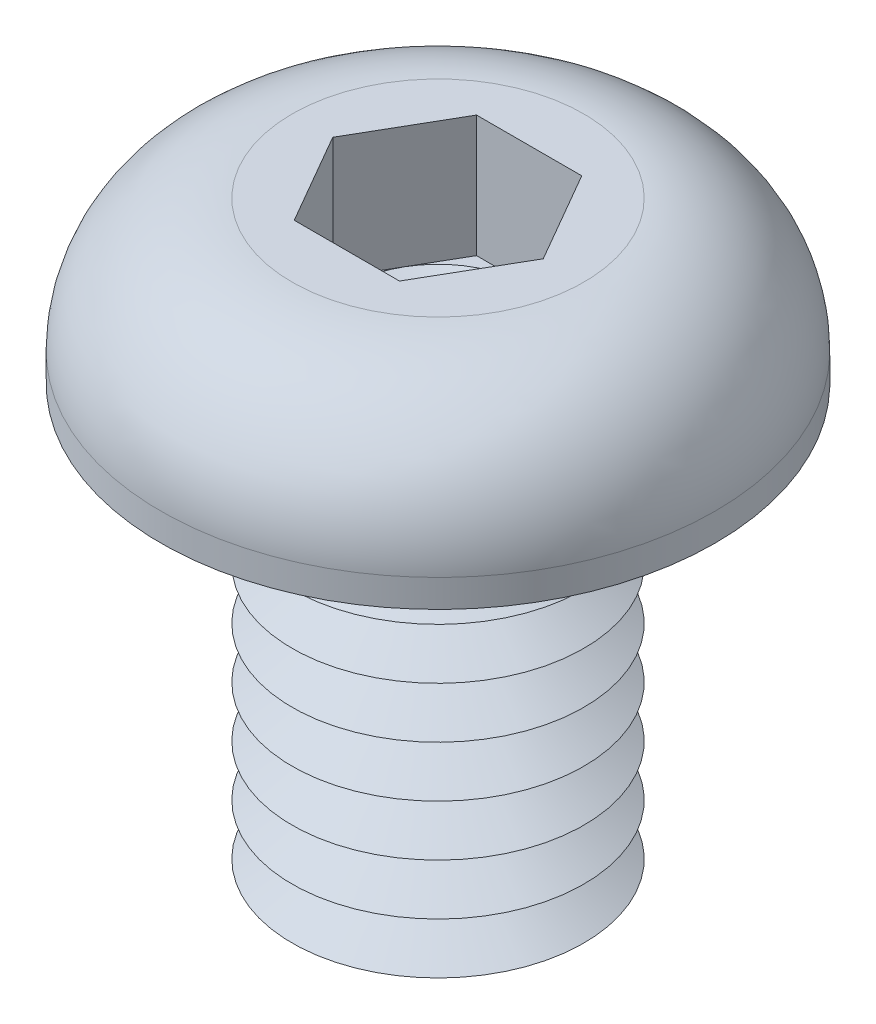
ISO-10303-21;
HEADER;
FILE_DESCRIPTION(('STEP AP214'),'2;1');
FILE_NAME('part.step','',(''),(''),'','','');
FILE_SCHEMA(('AUTOMOTIVE_DESIGN { 1 0 10303 214 1 1 1 1 }'));
ENDSEC;
DATA;
#1=APPLICATION_CONTEXT('core data for automotive mechanical design processes');
#2=APPLICATION_PROTOCOL_DEFINITION('international standard','automotive_design',2000,#1);
#3=PRODUCT_CONTEXT('',#1,'mechanical');
#4=PRODUCT('Part','Part','',(#3));
#5=PRODUCT_RELATED_PRODUCT_CATEGORY('part','',(#4));
#6=PRODUCT_DEFINITION_FORMATION('','',#4);
#7=PRODUCT_DEFINITION_CONTEXT('part definition',#1,'design');
#8=PRODUCT_DEFINITION('design','',#6,#7);
#9=PRODUCT_DEFINITION_SHAPE('','',#8);
#10=(LENGTH_UNIT() NAMED_UNIT(*) SI_UNIT(.MILLI.,.METRE.));
#11=(NAMED_UNIT(*) PLANE_ANGLE_UNIT() SI_UNIT($,.RADIAN.));
#12=(NAMED_UNIT(*) SI_UNIT($,.STERADIAN.) SOLID_ANGLE_UNIT());
#13=UNCERTAINTY_MEASURE_WITH_UNIT(LENGTH_MEASURE(1.E-05),#10,'distance_accuracy_value','');
#14=(GEOMETRIC_REPRESENTATION_CONTEXT(3) GLOBAL_UNCERTAINTY_ASSIGNED_CONTEXT((#13)) GLOBAL_UNIT_ASSIGNED_CONTEXT((#10,
#11,#12)) REPRESENTATION_CONTEXT('',''));
#15=CARTESIAN_POINT('',(0.,0.,0.));
#16=DIRECTION('',(0.,0.,1.));
#17=DIRECTION('',(1.,0.,0.));
#18=AXIS2_PLACEMENT_3D('',#15,#16,#17);
#19=CARTESIAN_POINT('',(0.,0.,0.));
#20=DIRECTION('',(0.,-1.,0.));
#21=DIRECTION('',(0.,0.,-1.));
#22=AXIS2_PLACEMENT_3D('',#19,#20,#21);
#23=TOROIDAL_SURFACE('',#22,2.35,0.35);
#24=CARTESIAN_POINT('',(0.,0.,-2.7));
#25=VERTEX_POINT('',#24);
#26=VERTEX_LOOP('',#25);
#27=FACE_BOUND('',#26,.T.);
#28=ADVANCED_FACE('P0_F12',(#27),#23,.T.);
#29=CLOSED_SHELL('',(#28));
#30=MANIFOLD_SOLID_BREP('P0_B1',#29);
#31=CARTESIAN_POINT('',(0.721687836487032,0.530000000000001,-1.25));
#32=DIRECTION('',(0.,1.,0.));
#33=DIRECTION('',(0.,0.,1.));
#34=AXIS2_PLACEMENT_3D('',#31,#32,#33);
#35=PLANE('',#34);
#36=CARTESIAN_POINT('',(0.,0.530000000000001,0.));
#37=DIRECTION('',(0.,1.,0.));
#38=DIRECTION('',(0.,0.,1.));
#39=AXIS2_PLACEMENT_3D('',#36,#37,#38);
#40=CIRCLE('',#39,1.25);
#41=CARTESIAN_POINT('',(0.,0.530000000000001,1.25));
#42=VERTEX_POINT('',#41);
#43=CARTESIAN_POINT('',(1.08253175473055,0.530000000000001,0.625));
#44=VERTEX_POINT('',#43);
#45=EDGE_CURVE('P1_E93',#42,#44,#40,.T.);
#46=ORIENTED_EDGE('',*,*,#45,.F.);
#47=DIRECTION('',(1.,0.,0.));
#48=VECTOR('',#47,1.);
#49=CARTESIAN_POINT('',(-0.721687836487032,0.530000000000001,1.25));
#50=LINE('',#49,#48);
#51=CARTESIAN_POINT('',(0.721687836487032,0.530000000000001,1.25));
#52=VERTEX_POINT('',#51);
#53=EDGE_CURVE('P1_E116',#42,#52,#50,.T.);
#54=ORIENTED_EDGE('',*,*,#53,.T.);
#55=DIRECTION('',(0.5,0.,-0.866025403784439));
#56=VECTOR('',#55,1.);
#57=CARTESIAN_POINT('',(0.721687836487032,0.530000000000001,1.25));
#58=LINE('',#57,#56);
#59=EDGE_CURVE('P1_E112',#52,#44,#58,.T.);
#60=ORIENTED_EDGE('',*,*,#59,.T.);
#61=EDGE_LOOP('',(#46,#54,#60));
#62=FACE_BOUND('',#61,.T.);
#63=ADVANCED_FACE('P1_F15',(#62),#35,.T.);
#64=CARTESIAN_POINT('',(0.,0.530000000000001,0.));
#65=DIRECTION('',(0.,1.,0.));
#66=DIRECTION('',(0.,0.,1.));
#67=AXIS2_PLACEMENT_3D('',#64,#65,#66);
#68=CIRCLE('',#67,1.25);
#69=CARTESIAN_POINT('',(1.08253175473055,0.530000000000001,-0.625));
#70=VERTEX_POINT('',#69);
#71=EDGE_CURVE('P1_E10',#44,#70,#68,.T.);
#72=ORIENTED_EDGE('',*,*,#71,.F.);
#73=CARTESIAN_POINT('',(1.44337567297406,0.530000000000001,0.));
#74=VERTEX_POINT('',#73);
#75=EDGE_CURVE('P1_E104',#44,#74,#58,.T.);
#76=ORIENTED_EDGE('',*,*,#75,.T.);
#77=DIRECTION('',(-0.5,0.,-0.866025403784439));
#78=VECTOR('',#77,1.);
#79=CARTESIAN_POINT('',(1.44337567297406,0.530000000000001,0.));
#80=LINE('',#79,#78);
#81=EDGE_CURVE('P1_E107',#74,#70,#80,.T.);
#82=ORIENTED_EDGE('',*,*,#81,.T.);
#83=EDGE_LOOP('',(#72,#76,#82));
#84=FACE_BOUND('',#83,.T.);
#85=ADVANCED_FACE('P1_F103',(#84),#35,.T.);
#86=CARTESIAN_POINT('',(0.,0.530000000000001,-1.25));
#87=VERTEX_POINT('',#86);
#88=EDGE_CURVE('P1_E24',#70,#87,#68,.T.);
#89=ORIENTED_EDGE('',*,*,#88,.F.);
#90=CARTESIAN_POINT('',(0.721687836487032,0.530000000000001,-1.25));
#91=VERTEX_POINT('',#90);
#92=EDGE_CURVE('P1_E139',#70,#91,#80,.T.);
#93=ORIENTED_EDGE('',*,*,#92,.T.);
#94=DIRECTION('',(-1.,0.,0.));
#95=VECTOR('',#94,1.);
#96=CARTESIAN_POINT('',(0.721687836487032,0.530000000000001,-1.25));
#97=LINE('',#96,#95);
#98=EDGE_CURVE('P1_E270',#91,#87,#97,.T.);
#99=ORIENTED_EDGE('',*,*,#98,.T.);
#100=EDGE_LOOP('',(#89,#93,#99));
#101=FACE_BOUND('',#100,.T.);
#102=ADVANCED_FACE('P1_F235',(#101),#35,.T.);
#103=CARTESIAN_POINT('',(-1.08253175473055,0.530000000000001,-0.625));
#104=VERTEX_POINT('',#103);
#105=EDGE_CURVE('P1_E265',#87,#104,#68,.T.);
#106=ORIENTED_EDGE('',*,*,#105,.F.);
#107=CARTESIAN_POINT('',(-0.721687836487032,0.530000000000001,-1.25));
#108=VERTEX_POINT('',#107);
#109=EDGE_CURVE('P1_E274',#87,#108,#97,.T.);
#110=ORIENTED_EDGE('',*,*,#109,.T.);
#111=DIRECTION('',(-0.5,0.,0.866025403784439));
#112=VECTOR('',#111,1.);
#113=CARTESIAN_POINT('',(-0.721687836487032,0.530000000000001,-1.25));
#114=LINE('',#113,#112);
#115=EDGE_CURVE('P1_E269',#108,#104,#114,.T.);
#116=ORIENTED_EDGE('',*,*,#115,.T.);
#117=EDGE_LOOP('',(#106,#110,#116));
#118=FACE_BOUND('',#117,.T.);
#119=ADVANCED_FACE('P1_F249',(#118),#35,.T.);
#120=CARTESIAN_POINT('',(-1.08253175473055,0.530000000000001,0.625));
#121=VERTEX_POINT('',#120);
#122=EDGE_CURVE('P1_E31',#104,#121,#68,.T.);
#123=ORIENTED_EDGE('',*,*,#122,.F.);
#124=CARTESIAN_POINT('',(-1.44337567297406,0.530000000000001,0.));
#125=VERTEX_POINT('',#124);
#126=EDGE_CURVE('P1_E261',#104,#125,#114,.T.);
#127=ORIENTED_EDGE('',*,*,#126,.T.);
#128=DIRECTION('',(0.5,0.,0.866025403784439));
#129=VECTOR('',#128,1.);
#130=CARTESIAN_POINT('',(-1.44337567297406,0.530000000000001,0.));
#131=LINE('',#130,#129);
#132=EDGE_CURVE('P1_E264',#125,#121,#131,.T.);
#133=ORIENTED_EDGE('',*,*,#132,.T.);
#134=EDGE_LOOP('',(#123,#127,#133));
#135=FACE_BOUND('',#134,.T.);
#136=ADVANCED_FACE('P1_F240',(#135),#35,.T.);
#137=CARTESIAN_POINT('',(0.,-5.3,0.));
#138=DIRECTION('',(0.,1.,0.));
#139=DIRECTION('',(0.,0.,1.));
#140=AXIS2_PLACEMENT_3D('',#137,#138,#139);
#141=CONICAL_SURFACE('',#140,1.39378221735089,1.0471975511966);
#142=CARTESIAN_POINT('',(0.,-4.95,0.));
#143=DIRECTION('',(0.,-1.,0.));
#144=DIRECTION('',(0.,0.,-1.));
#145=AXIS2_PLACEMENT_3D('',#142,#143,#144);
#146=CIRCLE('',#145,2.);
#147=CARTESIAN_POINT('',(0.,-4.95,-2.));
#148=VERTEX_POINT('',#147);
#149=EDGE_CURVE('P1_E197',#148,#148,#146,.T.);
#150=ORIENTED_EDGE('',*,*,#149,.T.);
#151=EDGE_LOOP('',(#150));
#152=FACE_BOUND('',#151,.T.);
#153=CARTESIAN_POINT('',(0.,-5.3,0.));
#154=DIRECTION('',(0.,-1.,0.));
#155=DIRECTION('',(0.,0.,-1.));
#156=AXIS2_PLACEMENT_3D('',#153,#154,#155);
#157=CIRCLE('',#156,1.39378221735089);
#158=CARTESIAN_POINT('',(0.,-5.3,-1.39378221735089));
#159=VERTEX_POINT('',#158);
#160=EDGE_CURVE('P1_E200',#159,#159,#157,.T.);
#161=ORIENTED_EDGE('',*,*,#160,.F.);
#162=EDGE_LOOP('',(#161));
#163=FACE_BOUND('',#162,.T.);
#164=ADVANCED_FACE('P1_F248',(#152,#163),#141,.T.);
#165=CARTESIAN_POINT('',(0.,-5.65,0.));
#166=DIRECTION('',(0.,-1.,0.));
#167=DIRECTION('',(0.,0.,-1.));
#168=AXIS2_PLACEMENT_3D('',#165,#166,#167);
#169=CONICAL_SURFACE('',#168,2.,1.0471975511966);
#170=ORIENTED_EDGE('',*,*,#160,.T.);
#171=EDGE_LOOP('',(#170));
#172=FACE_BOUND('',#171,.T.);
#173=CARTESIAN_POINT('',(0.,-5.65,0.));
#174=DIRECTION('',(0.,-1.,0.));
#175=DIRECTION('',(0.,0.,-1.));
#176=AXIS2_PLACEMENT_3D('',#173,#174,#175);
#177=CIRCLE('',#176,2.);
#178=CARTESIAN_POINT('',(0.,-5.65,-2.));
#179=VERTEX_POINT('',#178);
#180=EDGE_CURVE('P1_E203',#179,#179,#177,.T.);
#181=ORIENTED_EDGE('',*,*,#180,.F.);
#182=EDGE_LOOP('',(#181));
#183=FACE_BOUND('',#182,.T.);
#184=ADVANCED_FACE('P1_F255',(#172,#183),#169,.T.);
#185=CARTESIAN_POINT('',(0.,-6.,0.));
#186=DIRECTION('',(0.,1.,0.));
#187=DIRECTION('',(0.,0.,1.));
#188=AXIS2_PLACEMENT_3D('',#185,#186,#187);
#189=PLANE('',#188);
#190=CARTESIAN_POINT('',(0.,-6.,0.));
#191=DIRECTION('',(0.,-1.,0.));
#192=DIRECTION('',(0.,0.,-1.));
#193=AXIS2_PLACEMENT_3D('',#190,#191,#192);
#194=CIRCLE('',#193,1.39378221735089);
#195=CARTESIAN_POINT('',(0.,-6.,-1.39378221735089));
#196=VERTEX_POINT('',#195);
#197=EDGE_CURVE('P1_E206',#196,#196,#194,.T.);
#198=ORIENTED_EDGE('',*,*,#197,.T.);
#199=EDGE_LOOP('',(#198));
#200=FACE_BOUND('',#199,.T.);
#201=ADVANCED_FACE('P1_F333',(#200),#189,.F.);
#202=CARTESIAN_POINT('',(0.,-6.,0.));
#203=DIRECTION('',(0.,1.,0.));
#204=DIRECTION('',(0.,0.,1.));
#205=AXIS2_PLACEMENT_3D('',#202,#203,#204);
#206=CONICAL_SURFACE('',#205,1.39378221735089,1.0471975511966);
#207=ORIENTED_EDGE('',*,*,#180,.T.);
#208=EDGE_LOOP('',(#207));
#209=FACE_BOUND('',#208,.T.);
#210=ORIENTED_EDGE('',*,*,#197,.F.);
#211=EDGE_LOOP('',(#210));
#212=FACE_BOUND('',#211,.T.);
#213=ADVANCED_FACE('P1_F344',(#209,#212),#206,.T.);
#214=CARTESIAN_POINT('',(0.,-4.6,0.));
#215=DIRECTION('',(0.,1.,0.));
#216=DIRECTION('',(0.,0.,1.));
#217=AXIS2_PLACEMENT_3D('',#214,#215,#216);
#218=CONICAL_SURFACE('',#217,1.39378221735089,1.0471975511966);
#219=CARTESIAN_POINT('',(0.,-4.25,0.));
#220=DIRECTION('',(0.,-1.,0.));
#221=DIRECTION('',(0.,0.,-1.));
#222=AXIS2_PLACEMENT_3D('',#219,#220,#221);
#223=CIRCLE('',#222,2.);
#224=CARTESIAN_POINT('',(0.,-4.25,-2.));
#225=VERTEX_POINT('',#224);
#226=EDGE_CURVE('P1_E191',#225,#225,#223,.T.);
#227=ORIENTED_EDGE('',*,*,#226,.T.);
#228=EDGE_LOOP('',(#227));
#229=FACE_BOUND('',#228,.T.);
#230=CARTESIAN_POINT('',(0.,-4.6,0.));
#231=DIRECTION('',(0.,-1.,0.));
#232=DIRECTION('',(0.,0.,-1.));
#233=AXIS2_PLACEMENT_3D('',#230,#231,#232);
#234=CIRCLE('',#233,1.39378221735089);
#235=CARTESIAN_POINT('',(0.,-4.6,-1.39378221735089));
#236=VERTEX_POINT('',#235);
#237=EDGE_CURVE('P1_E194',#236,#236,#234,.T.);
#238=ORIENTED_EDGE('',*,*,#237,.F.);
#239=EDGE_LOOP('',(#238));
#240=FACE_BOUND('',#239,.T.);
#241=ADVANCED_FACE('P1_F353',(#229,#240),#218,.T.);
#242=CARTESIAN_POINT('',(0.,-4.95,0.));
#243=DIRECTION('',(0.,-1.,0.));
#244=DIRECTION('',(0.,0.,-1.));
#245=AXIS2_PLACEMENT_3D('',#242,#243,#244);
#246=CONICAL_SURFACE('',#245,2.,1.0471975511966);
#247=ORIENTED_EDGE('',*,*,#237,.T.);
#248=EDGE_LOOP('',(#247));
#249=FACE_BOUND('',#248,.T.);
#250=ORIENTED_EDGE('',*,*,#149,.F.);
#251=EDGE_LOOP('',(#250));
#252=FACE_BOUND('',#251,.T.);
#253=ADVANCED_FACE('P1_F362',(#249,#252),#246,.T.);
#254=CARTESIAN_POINT('',(0.,-3.9,0.));
#255=DIRECTION('',(0.,1.,0.));
#256=DIRECTION('',(0.,0.,1.));
#257=AXIS2_PLACEMENT_3D('',#254,#255,#256);
#258=CONICAL_SURFACE('',#257,1.39378221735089,1.0471975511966);
#259=CARTESIAN_POINT('',(0.,-3.55,0.));
#260=DIRECTION('',(0.,-1.,0.));
#261=DIRECTION('',(0.,0.,-1.));
#262=AXIS2_PLACEMENT_3D('',#259,#260,#261);
#263=CIRCLE('',#262,2.);
#264=CARTESIAN_POINT('',(0.,-3.55,-2.));
#265=VERTEX_POINT('',#264);
#266=EDGE_CURVE('P1_E185',#265,#265,#263,.T.);
#267=ORIENTED_EDGE('',*,*,#266,.T.);
#268=EDGE_LOOP('',(#267));
#269=FACE_BOUND('',#268,.T.);
#270=CARTESIAN_POINT('',(0.,-3.9,0.));
#271=DIRECTION('',(0.,-1.,0.));
#272=DIRECTION('',(0.,0.,-1.));
#273=AXIS2_PLACEMENT_3D('',#270,#271,#272);
#274=CIRCLE('',#273,1.39378221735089);
#275=CARTESIAN_POINT('',(0.,-3.9,-1.39378221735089));
#276=VERTEX_POINT('',#275);
#277=EDGE_CURVE('P1_E188',#276,#276,#274,.T.);
#278=ORIENTED_EDGE('',*,*,#277,.F.);
#279=EDGE_LOOP('',(#278));
#280=FACE_BOUND('',#279,.T.);
#281=ADVANCED_FACE('P1_F372',(#269,#280),#258,.T.);
#282=CARTESIAN_POINT('',(0.,-4.25,0.));
#283=DIRECTION('',(0.,-1.,0.));
#284=DIRECTION('',(0.,0.,-1.));
#285=AXIS2_PLACEMENT_3D('',#282,#283,#284);
#286=CONICAL_SURFACE('',#285,2.,1.0471975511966);
#287=ORIENTED_EDGE('',*,*,#277,.T.);
#288=EDGE_LOOP('',(#287));
#289=FACE_BOUND('',#288,.T.);
#290=ORIENTED_EDGE('',*,*,#226,.F.);
#291=EDGE_LOOP('',(#290));
#292=FACE_BOUND('',#291,.T.);
#293=ADVANCED_FACE('P1_F382',(#289,#292),#286,.T.);
#294=CARTESIAN_POINT('',(0.,-3.2,0.));
#295=DIRECTION('',(0.,1.,0.));
#296=DIRECTION('',(0.,0.,1.));
#297=AXIS2_PLACEMENT_3D('',#294,#295,#296);
#298=CONICAL_SURFACE('',#297,1.39378221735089,1.0471975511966);
#299=CARTESIAN_POINT('',(0.,-2.85,0.));
#300=DIRECTION('',(0.,-1.,0.));
#301=DIRECTION('',(0.,0.,-1.));
#302=AXIS2_PLACEMENT_3D('',#299,#300,#301);
#303=CIRCLE('',#302,2.);
#304=CARTESIAN_POINT('',(0.,-2.85,-2.));
#305=VERTEX_POINT('',#304);
#306=EDGE_CURVE('P1_E179',#305,#305,#303,.T.);
#307=ORIENTED_EDGE('',*,*,#306,.T.);
#308=EDGE_LOOP('',(#307));
#309=FACE_BOUND('',#308,.T.);
#310=CARTESIAN_POINT('',(0.,-3.2,0.));
#311=DIRECTION('',(0.,-1.,0.));
#312=DIRECTION('',(0.,0.,-1.));
#313=AXIS2_PLACEMENT_3D('',#310,#311,#312);
#314=CIRCLE('',#313,1.39378221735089);
#315=CARTESIAN_POINT('',(0.,-3.2,-1.39378221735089));
#316=VERTEX_POINT('',#315);
#317=EDGE_CURVE('P1_E182',#316,#316,#314,.T.);
#318=ORIENTED_EDGE('',*,*,#317,.F.);
#319=EDGE_LOOP('',(#318));
#320=FACE_BOUND('',#319,.T.);
#321=ADVANCED_FACE('P1_F392',(#309,#320),#298,.T.);
#322=CARTESIAN_POINT('',(0.,-3.55,0.));
#323=DIRECTION('',(0.,-1.,0.));
#324=DIRECTION('',(0.,0.,-1.));
#325=AXIS2_PLACEMENT_3D('',#322,#323,#324);
#326=CONICAL_SURFACE('',#325,2.,1.0471975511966);
#327=ORIENTED_EDGE('',*,*,#317,.T.);
#328=EDGE_LOOP('',(#327));
#329=FACE_BOUND('',#328,.T.);
#330=ORIENTED_EDGE('',*,*,#266,.F.);
#331=EDGE_LOOP('',(#330));
#332=FACE_BOUND('',#331,.T.);
#333=ADVANCED_FACE('P1_F402',(#329,#332),#326,.T.);
#334=CARTESIAN_POINT('',(0.,-2.5,0.));
#335=DIRECTION('',(0.,1.,0.));
#336=DIRECTION('',(0.,0.,1.));
#337=AXIS2_PLACEMENT_3D('',#334,#335,#336);
#338=CONICAL_SURFACE('',#337,1.39378221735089,1.0471975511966);
#339=CARTESIAN_POINT('',(0.,-2.15,0.));
#340=DIRECTION('',(0.,-1.,0.));
#341=DIRECTION('',(0.,0.,-1.));
#342=AXIS2_PLACEMENT_3D('',#339,#340,#341);
#343=CIRCLE('',#342,2.);
#344=CARTESIAN_POINT('',(0.,-2.15,-2.));
#345=VERTEX_POINT('',#344);
#346=EDGE_CURVE('P1_E173',#345,#345,#343,.T.);
#347=ORIENTED_EDGE('',*,*,#346,.T.);
#348=EDGE_LOOP('',(#347));
#349=FACE_BOUND('',#348,.T.);
#350=CARTESIAN_POINT('',(0.,-2.5,0.));
#351=DIRECTION('',(0.,-1.,0.));
#352=DIRECTION('',(0.,0.,-1.));
#353=AXIS2_PLACEMENT_3D('',#350,#351,#352);
#354=CIRCLE('',#353,1.39378221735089);
#355=CARTESIAN_POINT('',(0.,-2.5,-1.39378221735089));
#356=VERTEX_POINT('',#355);
#357=EDGE_CURVE('P1_E176',#356,#356,#354,.T.);
#358=ORIENTED_EDGE('',*,*,#357,.F.);
#359=EDGE_LOOP('',(#358));
#360=FACE_BOUND('',#359,.T.);
#361=ADVANCED_FACE('P1_F412',(#349,#360),#338,.T.);
#362=CARTESIAN_POINT('',(0.,-2.85,0.));
#363=DIRECTION('',(0.,-1.,0.));
#364=DIRECTION('',(0.,0.,-1.));
#365=AXIS2_PLACEMENT_3D('',#362,#363,#364);
#366=CONICAL_SURFACE('',#365,2.,1.0471975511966);
#367=ORIENTED_EDGE('',*,*,#357,.T.);
#368=EDGE_LOOP('',(#367));
#369=FACE_BOUND('',#368,.T.);
#370=ORIENTED_EDGE('',*,*,#306,.F.);
#371=EDGE_LOOP('',(#370));
#372=FACE_BOUND('',#371,.T.);
#373=ADVANCED_FACE('P1_F422',(#369,#372),#366,.T.);
#374=CARTESIAN_POINT('',(0.,-1.8,0.));
#375=DIRECTION('',(0.,1.,0.));
#376=DIRECTION('',(0.,0.,1.));
#377=AXIS2_PLACEMENT_3D('',#374,#375,#376);
#378=CONICAL_SURFACE('',#377,1.39378221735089,1.0471975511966);
#379=CARTESIAN_POINT('',(0.,-1.45,0.));
#380=DIRECTION('',(0.,-1.,0.));
#381=DIRECTION('',(0.,0.,-1.));
#382=AXIS2_PLACEMENT_3D('',#379,#380,#381);
#383=CIRCLE('',#382,2.);
#384=CARTESIAN_POINT('',(0.,-1.45,-2.));
#385=VERTEX_POINT('',#384);
#386=EDGE_CURVE('P1_E164',#385,#385,#383,.T.);
#387=ORIENTED_EDGE('',*,*,#386,.T.);
#388=EDGE_LOOP('',(#387));
#389=FACE_BOUND('',#388,.T.);
#390=CARTESIAN_POINT('',(0.,-1.8,0.));
#391=DIRECTION('',(0.,-1.,0.));
#392=DIRECTION('',(0.,0.,-1.));
#393=AXIS2_PLACEMENT_3D('',#390,#391,#392);
#394=CIRCLE('',#393,1.39378221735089);
#395=CARTESIAN_POINT('',(0.,-1.8,-1.39378221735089));
#396=VERTEX_POINT('',#395);
#397=EDGE_CURVE('P1_E170',#396,#396,#394,.T.);
#398=ORIENTED_EDGE('',*,*,#397,.F.);
#399=EDGE_LOOP('',(#398));
#400=FACE_BOUND('',#399,.T.);
#401=ADVANCED_FACE('P1_F432',(#389,#400),#378,.T.);
#402=CARTESIAN_POINT('',(0.,-2.15,0.));
#403=DIRECTION('',(0.,-1.,0.));
#404=DIRECTION('',(0.,0.,-1.));
#405=AXIS2_PLACEMENT_3D('',#402,#403,#404);
#406=CONICAL_SURFACE('',#405,2.,1.0471975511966);
#407=ORIENTED_EDGE('',*,*,#397,.T.);
#408=EDGE_LOOP('',(#407));
#409=FACE_BOUND('',#408,.T.);
#410=ORIENTED_EDGE('',*,*,#346,.F.);
#411=EDGE_LOOP('',(#410));
#412=FACE_BOUND('',#411,.T.);
#413=ADVANCED_FACE('P1_F442',(#409,#412),#406,.T.);
#414=CARTESIAN_POINT('',(0.,-1.1,0.));
#415=DIRECTION('',(0.,1.,0.));
#416=DIRECTION('',(0.,0.,1.));
#417=AXIS2_PLACEMENT_3D('',#414,#415,#416);
#418=CONICAL_SURFACE('',#417,1.39378221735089,1.0471975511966);
#419=CARTESIAN_POINT('',(0.,-0.750000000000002,0.));
#420=DIRECTION('',(0.,-1.,0.));
#421=DIRECTION('',(0.,0.,-1.));
#422=AXIS2_PLACEMENT_3D('',#419,#420,#421);
#423=CIRCLE('',#422,2.);
#424=CARTESIAN_POINT('',(0.,-0.750000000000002,-2.));
#425=VERTEX_POINT('',#424);
#426=EDGE_CURVE('P1_E167',#425,#425,#423,.T.);
#427=ORIENTED_EDGE('',*,*,#426,.T.);
#428=EDGE_LOOP('',(#427));
#429=FACE_BOUND('',#428,.T.);
#430=CARTESIAN_POINT('',(0.,-1.1,0.));
#431=DIRECTION('',(0.,-1.,0.));
#432=DIRECTION('',(0.,0.,-1.));
#433=AXIS2_PLACEMENT_3D('',#430,#431,#432);
#434=CIRCLE('',#433,1.39378221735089);
#435=CARTESIAN_POINT('',(0.,-1.1,-1.39378221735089));
#436=VERTEX_POINT('',#435);
#437=EDGE_CURVE('P1_E161',#436,#436,#434,.T.);
#438=ORIENTED_EDGE('',*,*,#437,.F.);
#439=EDGE_LOOP('',(#438));
#440=FACE_BOUND('',#439,.T.);
#441=ADVANCED_FACE('P1_F452',(#429,#440),#418,.T.);
#442=CARTESIAN_POINT('',(0.,-1.45,0.));
#443=DIRECTION('',(0.,-1.,0.));
#444=DIRECTION('',(0.,0.,-1.));
#445=AXIS2_PLACEMENT_3D('',#442,#443,#444);
#446=CONICAL_SURFACE('',#445,2.,1.0471975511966);
#447=ORIENTED_EDGE('',*,*,#437,.T.);
#448=EDGE_LOOP('',(#447));
#449=FACE_BOUND('',#448,.T.);
#450=ORIENTED_EDGE('',*,*,#386,.F.);
#451=EDGE_LOOP('',(#450));
#452=FACE_BOUND('',#451,.T.);
#453=ADVANCED_FACE('P1_F462',(#449,#452),#446,.T.);
#454=CARTESIAN_POINT('',(0.,-6.,0.));
#455=DIRECTION('',(0.,1.,0.));
#456=DIRECTION('',(0.,0.,1.));
#457=AXIS2_PLACEMENT_3D('',#454,#455,#456);
#458=CYLINDRICAL_SURFACE('',#457,2.);
#459=CARTESIAN_POINT('',(0.,0.,0.));
#460=DIRECTION('',(0.,-1.,0.));
#461=DIRECTION('',(1.,0.,0.));
#462=AXIS2_PLACEMENT_3D('',#459,#460,#461);
#463=CIRCLE('',#462,2.);
#464=CARTESIAN_POINT('',(2.,0.,0.));
#465=VERTEX_POINT('',#464);
#466=EDGE_CURVE('P1_E141',#465,#465,#463,.F.);
#467=ORIENTED_EDGE('',*,*,#466,.F.);
#468=EDGE_LOOP('',(#467));
#469=FACE_BOUND('',#468,.T.);
#470=ORIENTED_EDGE('',*,*,#426,.F.);
#471=EDGE_LOOP('',(#470));
#472=FACE_BOUND('',#471,.T.);
#473=ADVANCED_FACE('P1_F17',(#469,#472),#458,.T.);
#474=CARTESIAN_POINT('',(0.,0.,0.));
#475=DIRECTION('',(0.,-1.,0.));
#476=DIRECTION('',(0.,0.,-1.));
#477=AXIS2_PLACEMENT_3D('',#474,#475,#476);
#478=TOROIDAL_SURFACE('',#477,2.35,0.35);
#479=ORIENTED_EDGE('',*,*,#466,.T.);
#480=EDGE_LOOP('',(#479));
#481=FACE_BOUND('',#480,.T.);
#482=CARTESIAN_POINT('',(0.,0.,0.));
#483=DIRECTION('',(0.,1.,0.));
#484=DIRECTION('',(-1.,0.,0.));
#485=AXIS2_PLACEMENT_3D('',#482,#483,#484);
#486=CIRCLE('',#485,2.7);
#487=CARTESIAN_POINT('',(-2.7,0.,0.));
#488=VERTEX_POINT('',#487);
#489=EDGE_CURVE('P1_E151',#488,#488,#486,.F.);
#490=ORIENTED_EDGE('',*,*,#489,.T.);
#491=EDGE_LOOP('',(#490));
#492=FACE_BOUND('',#491,.T.);
#493=ADVANCED_FACE('P1_F211',(#481,#492),#478,.F.);
#494=CARTESIAN_POINT('',(2.,2.2,0.));
#495=DIRECTION('',(0.,-1.,0.));
#496=DIRECTION('',(1.,0.,0.));
#497=AXIS2_PLACEMENT_3D('',#494,#495,#496);
#498=PLANE('',#497);
#499=DIRECTION('',(-1.,0.,0.));
#500=VECTOR('',#499,1.);
#501=CARTESIAN_POINT('',(0.721687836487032,2.2,-1.25));
#502=LINE('',#501,#500);
#503=CARTESIAN_POINT('',(0.721687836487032,2.2,-1.25));
#504=VERTEX_POINT('',#503);
#505=CARTESIAN_POINT('',(-0.721687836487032,2.2,-1.25));
#506=VERTEX_POINT('',#505);
#507=EDGE_CURVE('P1_E125',#504,#506,#502,.T.);
#508=ORIENTED_EDGE('',*,*,#507,.F.);
#509=DIRECTION('',(-0.5,0.,-0.866025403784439));
#510=VECTOR('',#509,1.);
#511=CARTESIAN_POINT('',(1.44337567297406,2.2,0.));
#512=LINE('',#511,#510);
#513=CARTESIAN_POINT('',(1.44337567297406,2.2,0.));
#514=VERTEX_POINT('',#513);
#515=EDGE_CURVE('P1_E39',#514,#504,#512,.T.);
#516=ORIENTED_EDGE('',*,*,#515,.F.);
#517=DIRECTION('',(0.5,0.,-0.866025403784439));
#518=VECTOR('',#517,1.);
#519=CARTESIAN_POINT('',(0.721687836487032,2.2,1.25));
#520=LINE('',#519,#518);
#521=CARTESIAN_POINT('',(0.721687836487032,2.2,1.25));
#522=VERTEX_POINT('',#521);
#523=EDGE_CURVE('P1_E137',#522,#514,#520,.T.);
#524=ORIENTED_EDGE('',*,*,#523,.F.);
#525=DIRECTION('',(1.,0.,0.));
#526=VECTOR('',#525,1.);
#527=CARTESIAN_POINT('',(-0.721687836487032,2.2,1.25));
#528=LINE('',#527,#526);
#529=CARTESIAN_POINT('',(-0.721687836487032,2.2,1.25));
#530=VERTEX_POINT('',#529);
#531=EDGE_CURVE('P1_E134',#530,#522,#528,.T.);
#532=ORIENTED_EDGE('',*,*,#531,.F.);
#533=DIRECTION('',(0.5,0.,0.866025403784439));
#534=VECTOR('',#533,1.);
#535=CARTESIAN_POINT('',(-1.44337567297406,2.2,0.));
#536=LINE('',#535,#534);
#537=CARTESIAN_POINT('',(-1.44337567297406,2.2,0.));
#538=VERTEX_POINT('',#537);
#539=EDGE_CURVE('P1_E131',#538,#530,#536,.T.);
#540=ORIENTED_EDGE('',*,*,#539,.F.);
#541=DIRECTION('',(-0.5,0.,0.866025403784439));
#542=VECTOR('',#541,1.);
#543=CARTESIAN_POINT('',(-0.721687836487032,2.2,-1.25));
#544=LINE('',#543,#542);
#545=EDGE_CURVE('P1_E128',#506,#538,#544,.T.);
#546=ORIENTED_EDGE('',*,*,#545,.F.);
#547=EDGE_LOOP('',(#508,#516,#524,#532,#540,#546));
#548=FACE_BOUND('',#547,.T.);
#549=CARTESIAN_POINT('',(0.,2.2,0.));
#550=DIRECTION('',(0.,1.,0.));
#551=DIRECTION('',(-1.,0.,0.));
#552=AXIS2_PLACEMENT_3D('',#549,#550,#551);
#553=CIRCLE('',#552,2.);
#554=CARTESIAN_POINT('',(-2.,2.2,0.));
#555=VERTEX_POINT('',#554);
#556=EDGE_CURVE('P1_E152',#555,#555,#553,.T.);
#557=ORIENTED_EDGE('',*,*,#556,.T.);
#558=EDGE_LOOP('',(#557));
#559=FACE_BOUND('',#558,.T.);
#560=ADVANCED_FACE('P1_F289',(#548,#559),#498,.F.);
#561=CARTESIAN_POINT('',(0.,0.38,0.));
#562=DIRECTION('',(0.,1.,0.));
#563=DIRECTION('',(-1.,0.,0.));
#564=AXIS2_PLACEMENT_3D('',#561,#562,#563);
#565=TOROIDAL_SURFACE('',#564,1.97988888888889,1.82011111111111);
#566=ORIENTED_EDGE('',*,*,#556,.F.);
#567=EDGE_LOOP('',(#566));
#568=FACE_BOUND('',#567,.T.);
#569=CARTESIAN_POINT('',(0.,0.38,0.));
#570=DIRECTION('',(0.,1.,0.));
#571=DIRECTION('',(-1.,0.,0.));
#572=AXIS2_PLACEMENT_3D('',#569,#570,#571);
#573=CIRCLE('',#572,3.8);
#574=CARTESIAN_POINT('',(-3.8,0.38,0.));
#575=VERTEX_POINT('',#574);
#576=EDGE_CURVE('P1_E155',#575,#575,#573,.T.);
#577=ORIENTED_EDGE('',*,*,#576,.T.);
#578=EDGE_LOOP('',(#577));
#579=FACE_BOUND('',#578,.T.);
#580=ADVANCED_FACE('P1_F225',(#568,#579),#565,.T.);
#581=CARTESIAN_POINT('',(0.,2.2,0.));
#582=DIRECTION('',(0.,1.,0.));
#583=DIRECTION('',(-1.,0.,0.));
#584=AXIS2_PLACEMENT_3D('',#581,#582,#583);
#585=CYLINDRICAL_SURFACE('',#584,3.8);
#586=ORIENTED_EDGE('',*,*,#576,.F.);
#587=EDGE_LOOP('',(#586));
#588=FACE_BOUND('',#587,.T.);
#589=CARTESIAN_POINT('',(0.,0.,0.));
#590=DIRECTION('',(0.,1.,0.));
#591=DIRECTION('',(-1.,0.,0.));
#592=AXIS2_PLACEMENT_3D('',#589,#590,#591);
#593=CIRCLE('',#592,3.8);
#594=CARTESIAN_POINT('',(-3.8,0.,0.));
#595=VERTEX_POINT('',#594);
#596=EDGE_CURVE('P1_E158',#595,#595,#593,.T.);
#597=ORIENTED_EDGE('',*,*,#596,.T.);
#598=EDGE_LOOP('',(#597));
#599=FACE_BOUND('',#598,.T.);
#600=ADVANCED_FACE('P1_F216',(#588,#599),#585,.T.);
#601=CARTESIAN_POINT('',(0.,0.,0.));
#602=DIRECTION('',(0.,1.,0.));
#603=DIRECTION('',(-1.,0.,0.));
#604=AXIS2_PLACEMENT_3D('',#601,#602,#603);
#605=PLANE('',#604);
#606=ORIENTED_EDGE('',*,*,#596,.F.);
#607=EDGE_LOOP('',(#606));
#608=FACE_BOUND('',#607,.T.);
#609=ORIENTED_EDGE('',*,*,#489,.F.);
#610=EDGE_LOOP('',(#609));
#611=FACE_BOUND('',#610,.T.);
#612=ADVANCED_FACE('P1_F213',(#608,#611),#605,.F.);
#613=CARTESIAN_POINT('',(1.44337567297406,0.530000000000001,0.));
#614=DIRECTION('',(0.866025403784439,0.,-0.5));
#615=DIRECTION('',(-0.5,0.,-0.866025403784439));
#616=AXIS2_PLACEMENT_3D('',#613,#614,#615);
#617=PLANE('',#616);
#618=ORIENTED_EDGE('',*,*,#515,.T.);
#619=DIRECTION('',(0.,1.,0.));
#620=VECTOR('',#619,1.);
#621=CARTESIAN_POINT('',(0.721687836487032,0.530000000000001,-1.25));
#622=LINE('',#621,#620);
#623=EDGE_CURVE('P1_E118',#91,#504,#622,.T.);
#624=ORIENTED_EDGE('',*,*,#623,.F.);
#625=ORIENTED_EDGE('',*,*,#92,.F.);
#626=ORIENTED_EDGE('',*,*,#81,.F.);
#627=DIRECTION('',(0.,1.,0.));
#628=VECTOR('',#627,1.);
#629=CARTESIAN_POINT('',(1.44337567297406,0.530000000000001,0.));
#630=LINE('',#629,#628);
#631=EDGE_CURVE('P1_E113',#74,#514,#630,.T.);
#632=ORIENTED_EDGE('',*,*,#631,.T.);
#633=EDGE_LOOP('',(#618,#624,#625,#626,#632));
#634=FACE_BOUND('',#633,.T.);
#635=ADVANCED_FACE('P1_F215',(#634),#617,.F.);
#636=CARTESIAN_POINT('',(0.721687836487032,0.530000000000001,1.25));
#637=DIRECTION('',(0.866025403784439,0.,0.5));
#638=DIRECTION('',(0.5,0.,-0.866025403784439));
#639=AXIS2_PLACEMENT_3D('',#636,#637,#638);
#640=PLANE('',#639);
#641=ORIENTED_EDGE('',*,*,#523,.T.);
#642=ORIENTED_EDGE('',*,*,#631,.F.);
#643=ORIENTED_EDGE('',*,*,#75,.F.);
#644=ORIENTED_EDGE('',*,*,#59,.F.);
#645=DIRECTION('',(0.,1.,0.));
#646=VECTOR('',#645,1.);
#647=CARTESIAN_POINT('',(0.721687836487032,0.530000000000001,1.25));
#648=LINE('',#647,#646);
#649=EDGE_CURVE('P1_E142',#52,#522,#648,.T.);
#650=ORIENTED_EDGE('',*,*,#649,.T.);
#651=EDGE_LOOP('',(#641,#642,#643,#644,#650));
#652=FACE_BOUND('',#651,.T.);
#653=ADVANCED_FACE('P1_F111',(#652),#640,.F.);
#654=CARTESIAN_POINT('',(-0.721687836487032,0.530000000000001,1.25));
#655=DIRECTION('',(0.,0.,1.));
#656=DIRECTION('',(1.,0.,0.));
#657=AXIS2_PLACEMENT_3D('',#654,#655,#656);
#658=PLANE('',#657);
#659=ORIENTED_EDGE('',*,*,#531,.T.);
#660=ORIENTED_EDGE('',*,*,#649,.F.);
#661=ORIENTED_EDGE('',*,*,#53,.F.);
#662=CARTESIAN_POINT('',(-0.721687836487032,0.530000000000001,1.25));
#663=VERTEX_POINT('',#662);
#664=EDGE_CURVE('P1_E114',#663,#42,#50,.T.);
#665=ORIENTED_EDGE('',*,*,#664,.F.);
#666=DIRECTION('',(0.,1.,0.));
#667=VECTOR('',#666,1.);
#668=CARTESIAN_POINT('',(-0.721687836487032,0.530000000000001,1.25));
#669=LINE('',#668,#667);
#670=EDGE_CURVE('P1_E144',#663,#530,#669,.T.);
#671=ORIENTED_EDGE('',*,*,#670,.T.);
#672=EDGE_LOOP('',(#659,#660,#661,#665,#671));
#673=FACE_BOUND('',#672,.T.);
#674=ADVANCED_FACE('P1_F284',(#673),#658,.F.);
#675=CARTESIAN_POINT('',(-1.44337567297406,0.530000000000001,0.));
#676=DIRECTION('',(-0.866025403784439,0.,0.5));
#677=DIRECTION('',(0.5,0.,0.866025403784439));
#678=AXIS2_PLACEMENT_3D('',#675,#676,#677);
#679=PLANE('',#678);
#680=ORIENTED_EDGE('',*,*,#539,.T.);
#681=ORIENTED_EDGE('',*,*,#670,.F.);
#682=EDGE_CURVE('P1_E276',#121,#663,#131,.T.);
#683=ORIENTED_EDGE('',*,*,#682,.F.);
#684=ORIENTED_EDGE('',*,*,#132,.F.);
#685=DIRECTION('',(0.,1.,0.));
#686=VECTOR('',#685,1.);
#687=CARTESIAN_POINT('',(-1.44337567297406,0.530000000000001,0.));
#688=LINE('',#687,#686);
#689=EDGE_CURVE('P1_E146',#125,#538,#688,.T.);
#690=ORIENTED_EDGE('',*,*,#689,.T.);
#691=EDGE_LOOP('',(#680,#681,#683,#684,#690));
#692=FACE_BOUND('',#691,.T.);
#693=ADVANCED_FACE('P1_F540',(#692),#679,.F.);
#694=CARTESIAN_POINT('',(-0.721687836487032,0.530000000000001,-1.25));
#695=DIRECTION('',(-0.866025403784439,0.,-0.5));
#696=DIRECTION('',(-0.5,0.,0.866025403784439));
#697=AXIS2_PLACEMENT_3D('',#694,#695,#696);
#698=PLANE('',#697);
#699=ORIENTED_EDGE('',*,*,#545,.T.);
#700=ORIENTED_EDGE('',*,*,#689,.F.);
#701=ORIENTED_EDGE('',*,*,#126,.F.);
#702=ORIENTED_EDGE('',*,*,#115,.F.);
#703=DIRECTION('',(0.,1.,0.));
#704=VECTOR('',#703,1.);
#705=CARTESIAN_POINT('',(-0.721687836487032,0.530000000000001,-1.25));
#706=LINE('',#705,#704);
#707=EDGE_CURVE('P1_E119',#108,#506,#706,.T.);
#708=ORIENTED_EDGE('',*,*,#707,.T.);
#709=EDGE_LOOP('',(#699,#700,#701,#702,#708));
#710=FACE_BOUND('',#709,.T.);
#711=ADVANCED_FACE('P1_F244',(#710),#698,.F.);
#712=CARTESIAN_POINT('',(0.721687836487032,0.530000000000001,-1.25));
#713=DIRECTION('',(0.,0.,-1.));
#714=DIRECTION('',(-1.,0.,0.));
#715=AXIS2_PLACEMENT_3D('',#712,#713,#714);
#716=PLANE('',#715);
#717=ORIENTED_EDGE('',*,*,#507,.T.);
#718=ORIENTED_EDGE('',*,*,#707,.F.);
#719=ORIENTED_EDGE('',*,*,#109,.F.);
#720=ORIENTED_EDGE('',*,*,#98,.F.);
#721=ORIENTED_EDGE('',*,*,#623,.T.);
#722=EDGE_LOOP('',(#717,#718,#719,#720,#721));
#723=FACE_BOUND('',#722,.T.);
#724=ADVANCED_FACE('P1_F238',(#723),#716,.F.);
#725=EDGE_CURVE('P1_E19',#121,#42,#68,.T.);
#726=ORIENTED_EDGE('',*,*,#725,.F.);
#727=ORIENTED_EDGE('',*,*,#682,.T.);
#728=ORIENTED_EDGE('',*,*,#664,.T.);
#729=EDGE_LOOP('',(#726,#727,#728));
#730=FACE_BOUND('',#729,.T.);
#731=ADVANCED_FACE('P1_F90',(#730),#35,.T.);
#732=CARTESIAN_POINT('',(0.,0.530000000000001,0.));
#733=DIRECTION('',(0.,1.,0.));
#734=DIRECTION('',(0.,0.,1.));
#735=AXIS2_PLACEMENT_3D('',#732,#733,#734);
#736=CONICAL_SURFACE('',#735,1.25,1.0471975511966);
#737=CARTESIAN_POINT('',(0.,-0.191687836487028,0.));
#738=VERTEX_POINT('',#737);
#739=VERTEX_LOOP('',#738);
#740=FACE_BOUND('',#739,.T.);
#741=ORIENTED_EDGE('',*,*,#45,.T.);
#742=ORIENTED_EDGE('',*,*,#71,.T.);
#743=ORIENTED_EDGE('',*,*,#88,.T.);
#744=ORIENTED_EDGE('',*,*,#105,.T.);
#745=ORIENTED_EDGE('',*,*,#122,.T.);
#746=ORIENTED_EDGE('',*,*,#725,.T.);
#747=EDGE_LOOP('',(#741,#742,#743,#744,#745,#746));
#748=FACE_BOUND('',#747,.T.);
#749=ADVANCED_FACE('P1_F88',(#740,#748),#736,.F.);
#750=CLOSED_SHELL('',(#63,#85,#102,#119,#136,#164,#184,#201,#213,#241,#253,#281,#293,#321,#333,
#361,#373,#401,#413,#441,#453,#473,#493,#560,#580,#600,#612,#635,#653,#674,#693,#711,#724,#731,#749));
#751=MANIFOLD_SOLID_BREP('P1_B1',#750);
#752=ADVANCED_BREP_SHAPE_REPRESENTATION('',(#18,#30,#751),#14);
#753=SHAPE_DEFINITION_REPRESENTATION(#9,#752);
ENDSEC;
END-ISO-10303-21;
